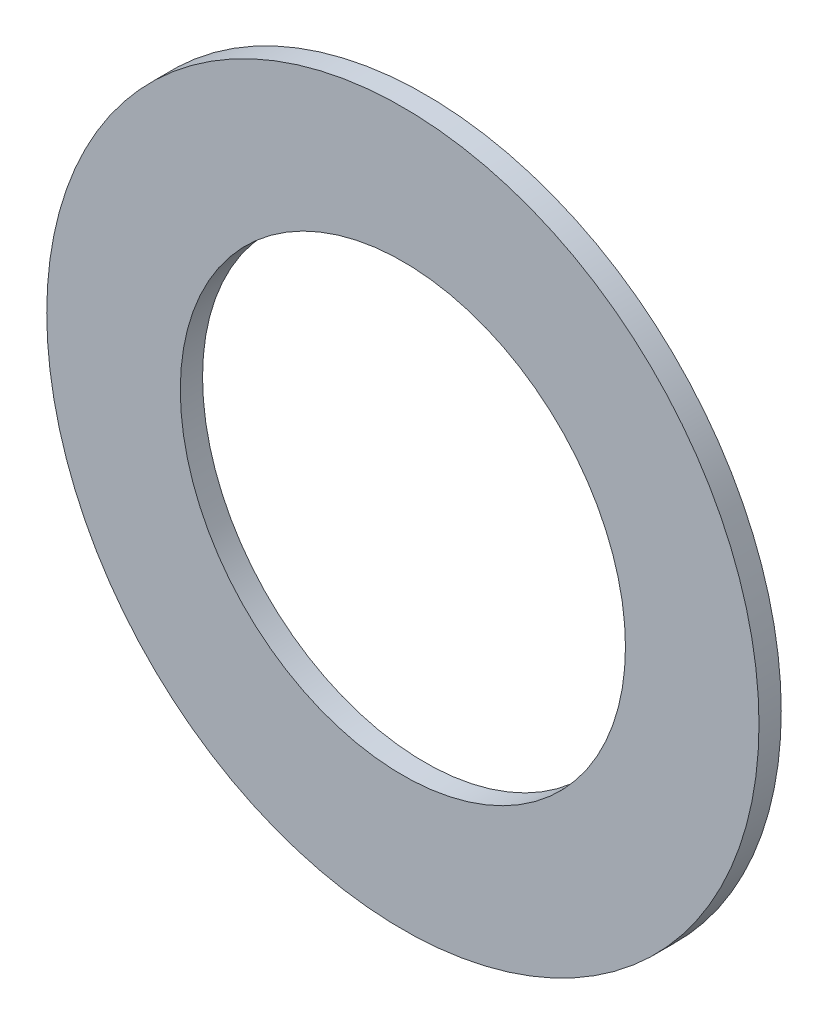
from build123d import *

# Parameters (mm, degrees)
ESQUISSE1_R          = 8
ESQUISSE1_R_2        = 5
BASE_EXTRUSION_DEPTH = 0.5


with BuildPart() as part:
    # Esquisse1 → Base-Extrusion (new body)
    with BuildSketch(Plane.XY):
        Circle(ESQUISSE1_R)
        Circle(ESQUISSE1_R_2, mode=Mode.SUBTRACT)
    extrude(amount=BASE_EXTRUSION_DEPTH)


solid = part.part
